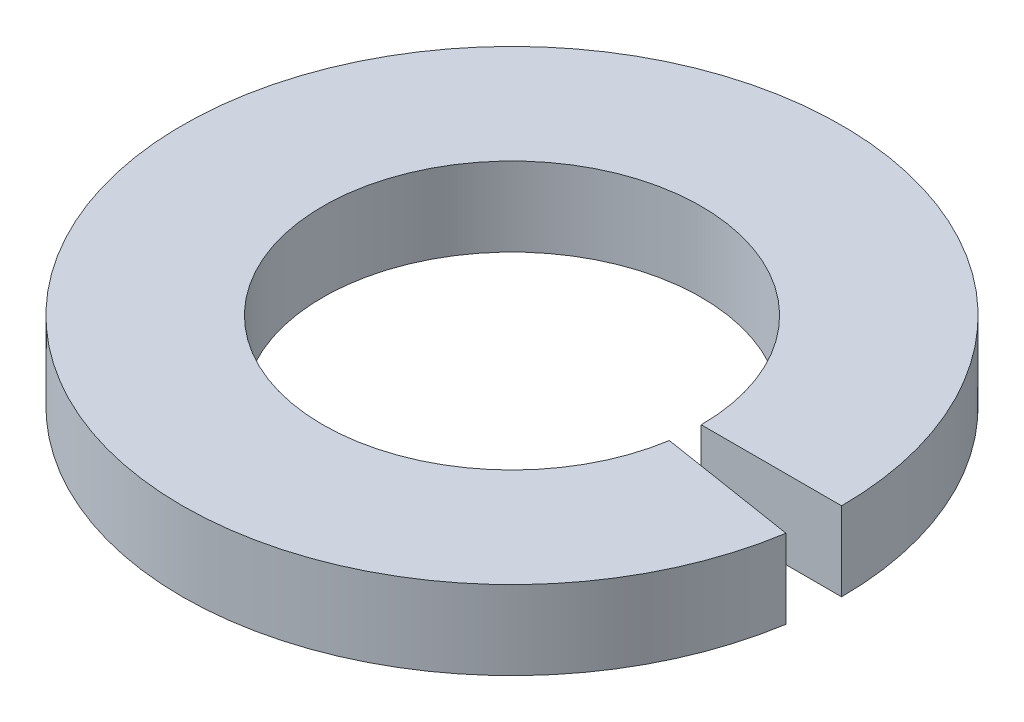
from build123d import *

# Parameters (mm, degrees)
SKETCH1_W          = 1.1303
SKETCH1_H          = 0.635
BASE_REVOLVE_ANGLE = 351


with BuildPart() as part:
    # Sketch1 → Base-Revolve (revolve)
    with BuildSketch(Plane.XY):
        with Locations((2.08915, 0.3175)):
            Rectangle(SKETCH1_W, SKETCH1_H)
    revolve(axis=Axis((0, -31.75, 0), (0, 1, 0)), revolution_arc=BASE_REVOLVE_ANGLE)


solid = part.part
